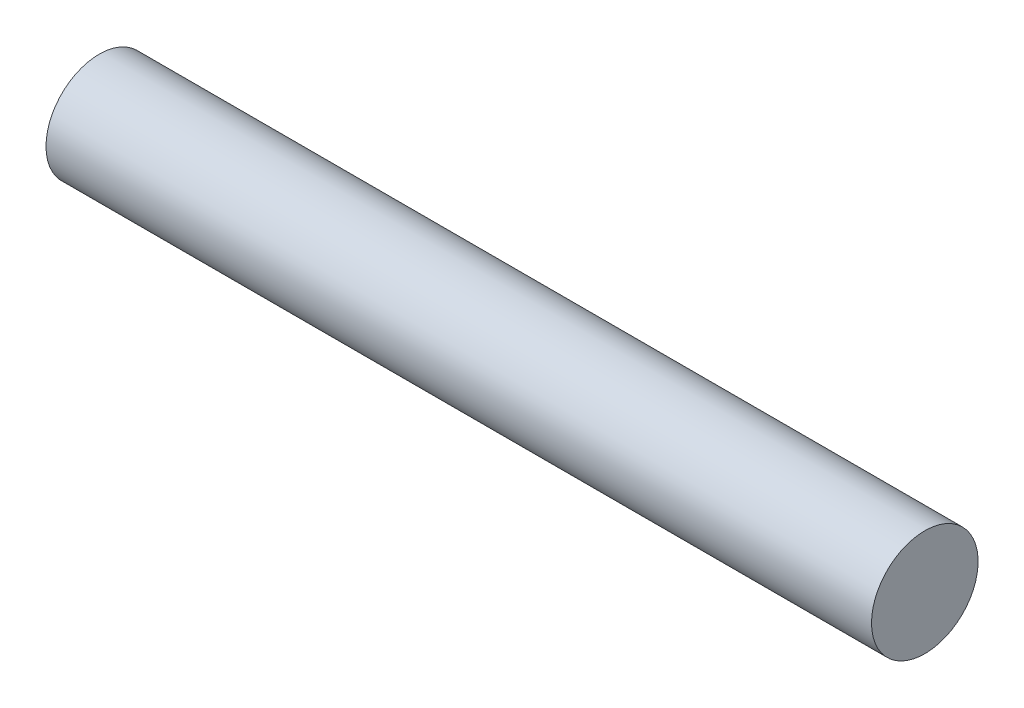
from build123d import *

# Parameters (mm, degrees)
SKIZZE1_W = 131.977172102
SKIZZE1_H = 8.520265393


with BuildPart() as part:
    # Skizze1 → Rotation1 (revolve)
    with BuildSketch(Plane.XY, mode=Mode.PRIVATE) as rotation1_sk:
        with Locations((5.56425495, -4.260132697)):
            Rectangle(SKIZZE1_W, SKIZZE1_H)
    revolve(rotation1_sk.sketch.rotate(Axis((-89.008847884, 0, 0), (1, 0, 0)), 270), axis=Axis((-89.008847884, 0, 0), (1, 0, 0)))


solid = part.part
